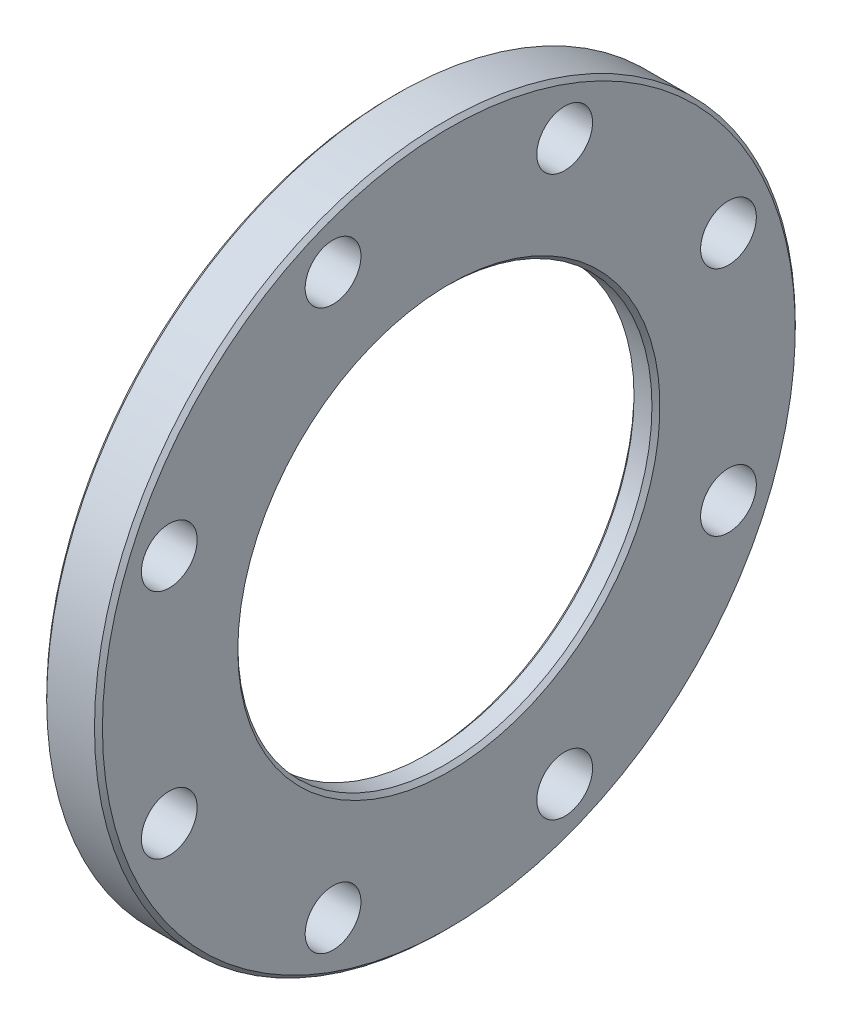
from build123d import *

# Parameters (mm, degrees)
CIRPATTERN1_COUNT = 8
CHAMFER1_SIZE     = 1.5875


with BuildPart() as part:
    # Sketch1 → Revolve1 (revolve)
    with BuildSketch(Plane(origin=(0, 0, 0), x_dir=(1, 0, 0), z_dir=(0, 1, 0)), mode=Mode.PRIVATE) as revolve1_sk:
        Polygon((0, 139.7), (0, 102.39375), (11.90498, 102.39375), (11.90498, 82.55), (22.225, 82.55), (22.225, 139.7), align=None)
    revolve(revolve1_sk.sketch.rotate(Axis((0, 0, 0), (1, 0, 0)), 180), axis=Axis((0, 0, 0), (1, 0, 0)))

    # Sketch2 → 7_8 _0.875_ Diameter Hole1 (revolve, cut)
    with BuildSketch(Plane(origin=(22.225, 46.170756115, 111.466065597), x_dir=(0, 0, -1), z_dir=(0, 1, 0))):
        Polygon((0, 0), (0, 82.877063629), (11.1125, 76.2), (11.1125, 0), align=None)
    f_7_8_0_875_diameter_hole1 = revolve(axis=Axis((28.575, 46.170756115, 111.466065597), (-1, 0, 0)), mode=Mode.SUBTRACT)

    # CirPattern1: 7_8 _0.875_ Diameter Hole1 ×8 about axis
    cirpattern1_axis = Axis((0, 0, 0), (1, 0, 0))
    for i in range(1, CIRPATTERN1_COUNT):
        add(f_7_8_0_875_diameter_hole1.rotate(cirpattern1_axis, i * 360 / CIRPATTERN1_COUNT), mode=Mode.SUBTRACT)

    # Chamfer1
    chamfer1_edges = [part.edges().sort_by_distance(p)[0] for p in [
        (22.225, 0, -139.7),
        (22.225, 0, -82.55),
        (11.90498, 0, -82.55),
        (0, 0, -102.39375),
        (0, 0, -139.7),
    ]]
    chamfer(chamfer1_edges, length=CHAMFER1_SIZE)


solid = part.part
